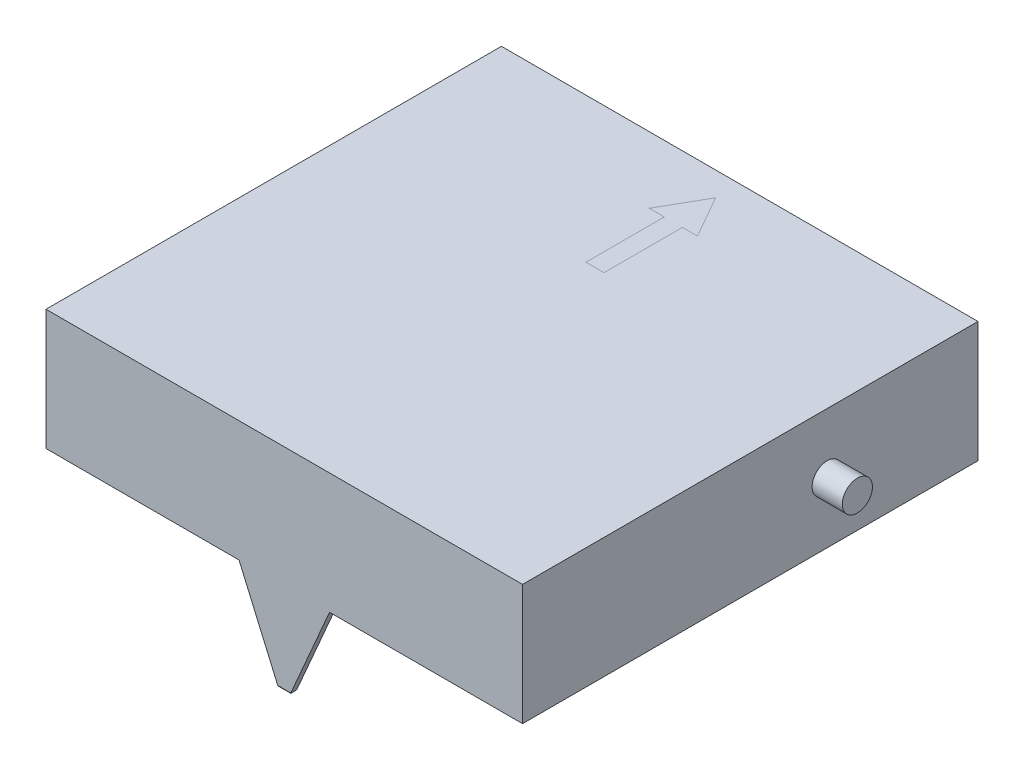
from build123d import *

# Parameters (mm, degrees)
SKETCH1_W                = 79
SKETCH1_H                = 75.5
BOSS_EXTRUDE1_DEPTH      = 20
BOSS_EXTRUDE2_DEPTH      = 1
BOSS_EXTRUDE3_DEPTH      = 5
BOSS_EXTRUDE3_DEPTH_BACK = 84
SKETCH3_R                = 2.5
FILLET1_R                = 0.25


with BuildPart() as part:
    # Sketch1 → Boss-Extrude1 (new body)
    with BuildSketch(Plane(origin=(0, 0, 0), x_dir=(1, 0, 0), z_dir=(0, 1, 0))):
        with Locations((39.5, 37.75)):
            Rectangle(SKETCH1_W, SKETCH1_H)
    extrude(amount=BOSS_EXTRUDE1_DEPTH)

    # Sketch2 → Boss-Extrude2 (add)
    with BuildSketch(Plane.XY):
        Polygon((32, 0), (38.5, -15), (40.5, -15), (47, 0), align=None)
    extrude(amount=-BOSS_EXTRUDE2_DEPTH)

    # Sketch3 → Boss-Extrude3 (add, two sides: drawn at the far end of the back side and taken through both)
    with BuildSketch(Plane(origin=(79, 0, 0), x_dir=(0, 0, -1), z_dir=(1, 0, 0)).offset(-BOSS_EXTRUDE3_DEPTH_BACK)):
        with Locations((50.5, 10)):
            Circle(SKETCH3_R)
    extrude(amount=BOSS_EXTRUDE3_DEPTH + BOSS_EXTRUDE3_DEPTH_BACK)

    # Fillet1
    fillet1_edges = [part.edges().sort_by_distance(p)[0] for p in [
        (39.5, -15, -1),
        (40.5, -15, -0.5),
        (38.5, -15, -0.5),
        (39.5, -15, 0),
    ]]
    fillet(fillet1_edges, radius=FILLET1_R)


solid = part.part
